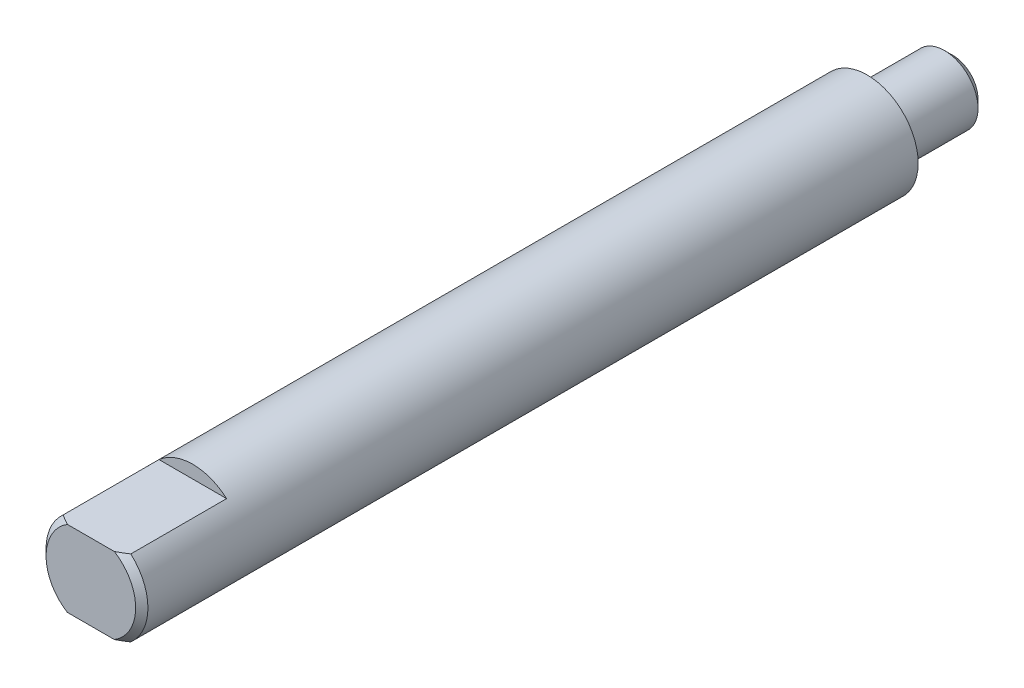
ISO-10303-21;
HEADER;
FILE_DESCRIPTION(('STEP AP214'),'2;1');
FILE_NAME('part.step','',(''),(''),'','','');
FILE_SCHEMA(('AUTOMOTIVE_DESIGN { 1 0 10303 214 1 1 1 1 }'));
ENDSEC;
DATA;
#1=APPLICATION_CONTEXT('core data for automotive mechanical design processes');
#2=APPLICATION_PROTOCOL_DEFINITION('international standard','automotive_design',2000,#1);
#3=PRODUCT_CONTEXT('',#1,'mechanical');
#4=PRODUCT('Part','Part','',(#3));
#5=PRODUCT_RELATED_PRODUCT_CATEGORY('part','',(#4));
#6=PRODUCT_DEFINITION_FORMATION('','',#4);
#7=PRODUCT_DEFINITION_CONTEXT('part definition',#1,'design');
#8=PRODUCT_DEFINITION('design','',#6,#7);
#9=PRODUCT_DEFINITION_SHAPE('','',#8);
#10=(LENGTH_UNIT() NAMED_UNIT(*) SI_UNIT(.MILLI.,.METRE.));
#11=(NAMED_UNIT(*) PLANE_ANGLE_UNIT() SI_UNIT($,.RADIAN.));
#12=(NAMED_UNIT(*) SI_UNIT($,.STERADIAN.) SOLID_ANGLE_UNIT());
#13=UNCERTAINTY_MEASURE_WITH_UNIT(LENGTH_MEASURE(1.E-05),#10,'distance_accuracy_value','');
#14=(GEOMETRIC_REPRESENTATION_CONTEXT(3) GLOBAL_UNCERTAINTY_ASSIGNED_CONTEXT((#13)) GLOBAL_UNIT_ASSIGNED_CONTEXT((#10,
#11,#12)) REPRESENTATION_CONTEXT('',''));
#15=CARTESIAN_POINT('',(0.,0.,0.));
#16=DIRECTION('',(0.,0.,1.));
#17=DIRECTION('',(1.,0.,0.));
#18=AXIS2_PLACEMENT_3D('',#15,#16,#17);
#19=CARTESIAN_POINT('',(0.,0.,3.684));
#20=DIRECTION('',(0.,0.,-1.));
#21=DIRECTION('',(-1.,0.,0.));
#22=AXIS2_PLACEMENT_3D('',#19,#20,#21);
#23=CONICAL_SURFACE('',#22,3.175,0.791934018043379);
#24=CARTESIAN_POINT('',(0.,0.,3.684));
#25=DIRECTION('',(0.,0.,1.));
#26=DIRECTION('',(1.,0.,0.));
#27=AXIS2_PLACEMENT_3D('',#24,#25,#26);
#28=CIRCLE('',#27,3.175);
#29=CARTESIAN_POINT('',(-2.10713075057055,2.375,3.684));
#30=VERTEX_POINT('',#29);
#31=CARTESIAN_POINT('',(-2.10713075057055,-2.375,3.684));
#32=VERTEX_POINT('',#31);
#33=EDGE_CURVE('E105',#30,#32,#28,.T.);
#34=ORIENTED_EDGE('',*,*,#33,.T.);
#35=CARTESIAN_POINT('',(-6.62966945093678,-2.375,-0.13301595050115));
#36=CARTESIAN_POINT('',(-6.41872085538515,-2.375,0.0629362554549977));
#37=CARTESIAN_POINT('',(-6.20729327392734,-2.375,0.258380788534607));
#38=CARTESIAN_POINT('',(-5.78286017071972,-2.375,0.64788739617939));
#39=CARTESIAN_POINT('',(-5.56985352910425,-2.375,0.841948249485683));
#40=CARTESIAN_POINT('',(-5.13574053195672,-2.375,1.23363349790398));
#41=CARTESIAN_POINT('',(-4.9145790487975,-2.375,1.43119690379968));
#42=CARTESIAN_POINT('',(-4.46963283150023,-2.375,1.82304516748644));
#43=CARTESIAN_POINT('',(-4.24585006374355,-2.375,2.01733224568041));
#44=CARTESIAN_POINT('',(-3.90719638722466,-2.375,2.30510248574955));
#45=CARTESIAN_POINT('',(-3.79385459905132,-2.375,2.40038380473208));
#46=CARTESIAN_POINT('',(-3.56590809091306,-2.375,2.5894215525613));
#47=CARTESIAN_POINT('',(-3.4513034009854,-2.375,2.68317801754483));
#48=CARTESIAN_POINT('',(-3.22025369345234,-2.375,2.86895465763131));
#49=CARTESIAN_POINT('',(-3.10380502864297,-2.375,2.96097030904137));
#50=CARTESIAN_POINT('',(-2.8689222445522,-2.375,3.14241965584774));
#51=CARTESIAN_POINT('',(-2.75048831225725,-2.375,3.23185359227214));
#52=CARTESIAN_POINT('',(-2.51255729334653,-2.375,3.40617108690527));
#53=CARTESIAN_POINT('',(-2.3930916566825,-2.375,3.49109735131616));
#54=CARTESIAN_POINT('',(-2.1509050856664,-2.375,3.65634247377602));
#55=CARTESIAN_POINT('',(-2.02818269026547,-2.375,3.73665921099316));
#56=CARTESIAN_POINT('',(-1.77912466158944,-2.375,3.89039659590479));
#57=CARTESIAN_POINT('',(-1.65280524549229,-2.375,3.96384327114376));
#58=CARTESIAN_POINT('',(-1.39512518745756,-2.375,4.10119391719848));
#59=CARTESIAN_POINT('',(-1.26377071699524,-2.375,4.16510912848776));
#60=CARTESIAN_POINT('',(-1.05701971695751,-2.375,4.25273595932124));
#61=CARTESIAN_POINT('',(-0.983728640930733,-2.375,4.28140199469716));
#62=CARTESIAN_POINT('',(-0.83535687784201,-2.375,4.3337772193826));
#63=CARTESIAN_POINT('',(-0.760275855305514,-2.375,4.35748547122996));
#64=CARTESIAN_POINT('',(-0.608898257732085,-2.375,4.39885359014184));
#65=CARTESIAN_POINT('',(-0.532610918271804,-2.375,4.41654679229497));
#66=CARTESIAN_POINT('',(-0.378780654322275,-2.375,4.445154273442));
#67=CARTESIAN_POINT('',(-0.301238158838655,-2.375,4.45607082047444));
#68=CARTESIAN_POINT('',(-0.144559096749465,-2.375,4.47054748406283));
#69=CARTESIAN_POINT('',(-0.0654144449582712,-2.375,4.47402190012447));
#70=CARTESIAN_POINT('',(0.0928249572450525,-2.375,4.47312081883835));
#71=CARTESIAN_POINT('',(0.171919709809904,-2.375,4.4687456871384));
#72=CARTESIAN_POINT('',(0.329626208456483,-2.375,4.45241265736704));
#73=CARTESIAN_POINT('',(0.408234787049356,-2.375,4.44042470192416));
#74=CARTESIAN_POINT('',(0.56408615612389,-2.375,4.40957980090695));
#75=CARTESIAN_POINT('',(0.641328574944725,-2.375,4.39072101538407));
#76=CARTESIAN_POINT('',(0.827865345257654,-2.375,4.33746225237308));
#77=CARTESIAN_POINT('',(0.936246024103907,-2.375,4.29987709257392));
#78=CARTESIAN_POINT('',(1.14927492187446,-2.375,4.21535984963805));
#79=CARTESIAN_POINT('',(1.25392057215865,-2.375,4.16842147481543));
#80=CARTESIAN_POINT('',(1.46087103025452,-2.375,4.06709514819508));
#81=CARTESIAN_POINT('',(1.56313950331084,-2.375,4.01263383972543));
#82=CARTESIAN_POINT('',(1.71427099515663,-2.375,3.92703840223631));
#83=CARTESIAN_POINT('',(1.76426245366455,-2.375,3.89786057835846));
#84=CARTESIAN_POINT('',(1.86356372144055,-2.375,3.83837009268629));
#85=CARTESIAN_POINT('',(1.91287355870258,-2.375,3.80805747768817));
#86=CARTESIAN_POINT('',(2.07522042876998,-2.375,3.70601224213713));
#87=CARTESIAN_POINT('',(2.18692206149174,-2.375,3.63215349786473));
#88=CARTESIAN_POINT('',(2.40772318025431,-2.375,3.48062951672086));
#89=CARTESIAN_POINT('',(2.5168220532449,-2.375,3.40296339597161));
#90=CARTESIAN_POINT('',(2.73301390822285,-2.375,3.24473477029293));
#91=CARTESIAN_POINT('',(2.84010537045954,-2.375,3.16417019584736));
#92=CARTESIAN_POINT('',(3.05261723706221,-2.375,3.00086187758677));
#93=CARTESIAN_POINT('',(3.15803753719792,-2.375,2.9181179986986));
#94=CARTESIAN_POINT('',(3.47300086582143,-2.375,2.6667998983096));
#95=CARTESIAN_POINT('',(3.68051445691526,-2.375,2.49568568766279));
#96=CARTESIAN_POINT('',(4.09182405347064,-2.375,2.14926116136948));
#97=CARTESIAN_POINT('',(4.29562161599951,-2.375,1.97395267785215));
#98=CARTESIAN_POINT('',(4.67931232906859,-2.375,1.63905531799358));
#99=CARTESIAN_POINT('',(4.85946034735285,-2.375,1.47975783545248));
#100=CARTESIAN_POINT('',(5.21824582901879,-2.375,1.15942835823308));
#101=CARTESIAN_POINT('',(5.39688309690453,-2.375,0.998396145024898));
#102=CARTESIAN_POINT('',(5.75173692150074,-2.375,0.676174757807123));
#103=CARTESIAN_POINT('',(5.92796166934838,-2.375,0.514994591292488));
#104=CARTESIAN_POINT('',(6.27946145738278,-2.375,0.191659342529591));
#105=CARTESIAN_POINT('',(6.45473664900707,-2.375,0.0295044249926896));
#106=CARTESIAN_POINT('',(6.62966945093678,-2.375,-0.13301595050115));
#107=B_SPLINE_CURVE_WITH_KNOTS('',3,(#35,#36,#37,#38,#39,#40,#41,#42,#43,#44,#45,#46,#47,#48,
#49,#50,#51,#52,#53,#54,#55,#56,#57,#58,#59,#60,#61,#62,#63,#64,#65,#66,#67,#68,#69,#70,#71,#72,
#73,#74,#75,#76,#77,#78,#79,#80,#81,#82,#83,#84,#85,#86,#87,#88,#89,#90,#91,#92,#93,#94,#95,#96,
#97,#98,#99,#100,#101,#102,#103,#104,#105,#106),.UNSPECIFIED.,.F.,.F.,(4,2,2,2,2,2,2,2,2,2,2,2,
2,2,2,2,2,2,2,2,2,2,2,2,2,2,2,2,2,2,2,2,2,2,2,4),(0.,0.863760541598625,1.72820709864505,
2.61784876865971,3.50686109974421,3.95106286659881,4.39525409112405,4.84047397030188,
5.28565214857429,5.72530383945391,6.16515621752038,6.60326828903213,7.04085953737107,
7.2768120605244,7.51280915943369,7.74747620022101,7.98206465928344,8.21934033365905,
8.45660495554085,8.69481223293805,8.93308334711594,9.27660606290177,9.62036064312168,
9.96774119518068,10.1413805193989,10.3150126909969,10.7166254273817,11.1183318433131,
11.5203310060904,11.9223551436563,12.7291420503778,13.5355827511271,14.2569976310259,
14.9785044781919,15.6949553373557,16.4112883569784),.UNSPECIFIED.);
#108=CARTESIAN_POINT('',(-1.46406113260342,-2.375,4.064));
#109=VERTEX_POINT('',#108);
#110=EDGE_CURVE('E128',#32,#109,#107,.T.);
#111=ORIENTED_EDGE('',*,*,#110,.T.);
#112=CARTESIAN_POINT('',(0.,0.,4.064));
#113=DIRECTION('',(0.,0.,1.));
#114=DIRECTION('',(1.,0.,0.));
#115=AXIS2_PLACEMENT_3D('',#112,#113,#114);
#116=CIRCLE('',#115,2.79);
#117=CARTESIAN_POINT('',(-1.46406113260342,2.375,4.064));
#118=VERTEX_POINT('',#117);
#119=EDGE_CURVE('E115',#118,#109,#116,.T.);
#120=ORIENTED_EDGE('',*,*,#119,.F.);
#121=CARTESIAN_POINT('',(6.62966945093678,2.375,-0.13301595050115));
#122=CARTESIAN_POINT('',(6.41872085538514,2.375,0.0629362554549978));
#123=CARTESIAN_POINT('',(6.20729327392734,2.375,0.258380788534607));
#124=CARTESIAN_POINT('',(5.78286017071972,2.375,0.64788739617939));
#125=CARTESIAN_POINT('',(5.56985352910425,2.375,0.841948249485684));
#126=CARTESIAN_POINT('',(5.13574053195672,2.375,1.23363349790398));
#127=CARTESIAN_POINT('',(4.9145790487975,2.375,1.43119690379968));
#128=CARTESIAN_POINT('',(4.46963283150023,2.375,1.82304516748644));
#129=CARTESIAN_POINT('',(4.24585006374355,2.375,2.01733224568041));
#130=CARTESIAN_POINT('',(3.90719638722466,2.375,2.30510248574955));
#131=CARTESIAN_POINT('',(3.79385459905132,2.375,2.40038380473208));
#132=CARTESIAN_POINT('',(3.56590809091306,2.375,2.5894215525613));
#133=CARTESIAN_POINT('',(3.4513034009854,2.375,2.68317801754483));
#134=CARTESIAN_POINT('',(3.22025369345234,2.375,2.86895465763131));
#135=CARTESIAN_POINT('',(3.10380502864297,2.375,2.96097030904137));
#136=CARTESIAN_POINT('',(2.8689222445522,2.375,3.14241965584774));
#137=CARTESIAN_POINT('',(2.75048831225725,2.375,3.23185359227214));
#138=CARTESIAN_POINT('',(2.51255729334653,2.375,3.40617108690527));
#139=CARTESIAN_POINT('',(2.3930916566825,2.375,3.49109735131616));
#140=CARTESIAN_POINT('',(2.1509050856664,2.375,3.65634247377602));
#141=CARTESIAN_POINT('',(2.02818269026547,2.375,3.73665921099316));
#142=CARTESIAN_POINT('',(1.77912466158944,2.375,3.89039659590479));
#143=CARTESIAN_POINT('',(1.65280524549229,2.375,3.96384327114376));
#144=CARTESIAN_POINT('',(1.39512518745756,2.375,4.10119391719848));
#145=CARTESIAN_POINT('',(1.26377071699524,2.375,4.16510912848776));
#146=CARTESIAN_POINT('',(1.05701971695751,2.375,4.25273595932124));
#147=CARTESIAN_POINT('',(0.983728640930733,2.375,4.28140199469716));
#148=CARTESIAN_POINT('',(0.83535687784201,2.375,4.3337772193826));
#149=CARTESIAN_POINT('',(0.760275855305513,2.375,4.35748547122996));
#150=CARTESIAN_POINT('',(0.608898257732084,2.375,4.39885359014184));
#151=CARTESIAN_POINT('',(0.532610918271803,2.375,4.41654679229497));
#152=CARTESIAN_POINT('',(0.378780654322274,2.375,4.445154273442));
#153=CARTESIAN_POINT('',(0.301238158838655,2.375,4.45607082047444));
#154=CARTESIAN_POINT('',(0.144559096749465,2.375,4.47054748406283));
#155=CARTESIAN_POINT('',(0.0654144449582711,2.375,4.47402190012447));
#156=CARTESIAN_POINT('',(-0.0928249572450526,2.375,4.47312081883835));
#157=CARTESIAN_POINT('',(-0.171919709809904,2.375,4.4687456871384));
#158=CARTESIAN_POINT('',(-0.329626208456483,2.375,4.45241265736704));
#159=CARTESIAN_POINT('',(-0.408234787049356,2.375,4.44042470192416));
#160=CARTESIAN_POINT('',(-0.56408615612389,2.375,4.40957980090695));
#161=CARTESIAN_POINT('',(-0.641328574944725,2.375,4.39072101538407));
#162=CARTESIAN_POINT('',(-0.827865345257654,2.375,4.33746225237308));
#163=CARTESIAN_POINT('',(-0.936246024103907,2.375,4.29987709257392));
#164=CARTESIAN_POINT('',(-1.14927492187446,2.375,4.21535984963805));
#165=CARTESIAN_POINT('',(-1.25392057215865,2.375,4.16842147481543));
#166=CARTESIAN_POINT('',(-1.46087103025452,2.375,4.06709514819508));
#167=CARTESIAN_POINT('',(-1.56313950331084,2.375,4.01263383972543));
#168=CARTESIAN_POINT('',(-1.71427099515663,2.375,3.92703840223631));
#169=CARTESIAN_POINT('',(-1.76426245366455,2.375,3.89786057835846));
#170=CARTESIAN_POINT('',(-1.86356372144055,2.375,3.83837009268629));
#171=CARTESIAN_POINT('',(-1.91287355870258,2.375,3.80805747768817));
#172=CARTESIAN_POINT('',(-2.07522042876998,2.375,3.70601224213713));
#173=CARTESIAN_POINT('',(-2.18692206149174,2.375,3.63215349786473));
#174=CARTESIAN_POINT('',(-2.40772318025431,2.375,3.48062951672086));
#175=CARTESIAN_POINT('',(-2.51682205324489,2.375,3.40296339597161));
#176=CARTESIAN_POINT('',(-2.73301390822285,2.375,3.24473477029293));
#177=CARTESIAN_POINT('',(-2.84010537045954,2.375,3.16417019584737));
#178=CARTESIAN_POINT('',(-3.05261723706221,2.375,3.00086187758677));
#179=CARTESIAN_POINT('',(-3.15803753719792,2.375,2.91811799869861));
#180=CARTESIAN_POINT('',(-3.47300086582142,2.375,2.66679989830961));
#181=CARTESIAN_POINT('',(-3.68051445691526,2.375,2.49568568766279));
#182=CARTESIAN_POINT('',(-4.09182405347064,2.375,2.14926116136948));
#183=CARTESIAN_POINT('',(-4.29562161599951,2.375,1.97395267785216));
#184=CARTESIAN_POINT('',(-4.67931232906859,2.375,1.63905531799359));
#185=CARTESIAN_POINT('',(-4.85946034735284,2.375,1.47975783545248));
#186=CARTESIAN_POINT('',(-5.21824582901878,2.375,1.15942835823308));
#187=CARTESIAN_POINT('',(-5.39688309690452,2.375,0.998396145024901));
#188=CARTESIAN_POINT('',(-5.75173692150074,2.375,0.676174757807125));
#189=CARTESIAN_POINT('',(-5.92796166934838,2.375,0.514994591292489));
#190=CARTESIAN_POINT('',(-6.27946145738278,2.375,0.191659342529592));
#191=CARTESIAN_POINT('',(-6.45473664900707,2.375,0.0295044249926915));
#192=CARTESIAN_POINT('',(-6.62966945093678,2.375,-0.13301595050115));
#193=B_SPLINE_CURVE_WITH_KNOTS('',3,(#121,#122,#123,#124,#125,#126,#127,#128,#129,#130,#131,
#132,#133,#134,#135,#136,#137,#138,#139,#140,#141,#142,#143,#144,#145,#146,#147,#148,#149,#150,
#151,#152,#153,#154,#155,#156,#157,#158,#159,#160,#161,#162,#163,#164,#165,#166,#167,#168,#169,
#170,#171,#172,#173,#174,#175,#176,#177,#178,#179,#180,#181,#182,#183,#184,#185,#186,#187,#188,
#189,#190,#191,#192),.UNSPECIFIED.,.F.,.F.,(4,2,2,2,2,2,2,2,2,2,2,2,2,2,2,2,2,2,2,2,2,2,2,2,2,2,
2,2,2,2,2,2,2,2,2,4),(0.,0.863760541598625,1.72820709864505,2.61784876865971,3.50686109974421,
3.95106286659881,4.39525409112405,4.84047397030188,5.28565214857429,5.72530383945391,
6.16515621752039,6.60326828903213,7.04085953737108,7.2768120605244,7.51280915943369,
7.74747620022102,7.98206465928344,8.21934033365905,8.45660495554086,8.69481223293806,
8.93308334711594,9.27660606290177,9.62036064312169,9.96774119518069,10.1413805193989,
10.3150126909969,10.7166254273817,11.1183318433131,11.5203310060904,11.9223551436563,
12.7291420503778,13.5355827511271,14.2569976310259,14.9785044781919,15.6949553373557,
16.4112883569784),.UNSPECIFIED.);
#194=EDGE_CURVE('E129',#118,#30,#193,.T.);
#195=ORIENTED_EDGE('',*,*,#194,.T.);
#196=EDGE_LOOP('',(#34,#111,#120,#195));
#197=FACE_BOUND('',#196,.T.);
#198=ADVANCED_FACE('F33',(#197),#23,.T.);
#199=CARTESIAN_POINT('',(0.,0.,4.064));
#200=DIRECTION('',(0.,0.,-1.));
#201=DIRECTION('',(-1.,0.,0.));
#202=AXIS2_PLACEMENT_3D('',#199,#200,#201);
#203=PLANE('',#202);
#204=ORIENTED_EDGE('',*,*,#119,.T.);
#205=DIRECTION('',(1.,0.,0.));
#206=VECTOR('',#205,1.);
#207=CARTESIAN_POINT('',(-5.,-2.375,4.064));
#208=LINE('',#207,#206);
#209=CARTESIAN_POINT('',(1.46406113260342,-2.375,4.064));
#210=VERTEX_POINT('',#209);
#211=EDGE_CURVE('E95',#109,#210,#208,.T.);
#212=ORIENTED_EDGE('',*,*,#211,.T.);
#213=CARTESIAN_POINT('',(1.46406113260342,2.375,4.064));
#214=VERTEX_POINT('',#213);
#215=EDGE_CURVE('E109',#210,#214,#116,.T.);
#216=ORIENTED_EDGE('',*,*,#215,.T.);
#217=DIRECTION('',(1.,0.,0.));
#218=VECTOR('',#217,1.);
#219=CARTESIAN_POINT('',(-5.,2.375,4.064));
#220=LINE('',#219,#218);
#221=EDGE_CURVE('E135',#118,#214,#220,.T.);
#222=ORIENTED_EDGE('',*,*,#221,.F.);
#223=EDGE_LOOP('',(#204,#212,#216,#222));
#224=FACE_BOUND('',#223,.T.);
#225=ADVANCED_FACE('F35',(#224),#203,.F.);
#226=ORIENTED_EDGE('',*,*,#215,.F.);
#227=CARTESIAN_POINT('',(2.10713075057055,-2.375,3.684));
#228=VERTEX_POINT('',#227);
#229=EDGE_CURVE('E94',#210,#228,#107,.T.);
#230=ORIENTED_EDGE('',*,*,#229,.T.);
#231=CARTESIAN_POINT('',(2.10713075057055,2.375,3.684));
#232=VERTEX_POINT('',#231);
#233=EDGE_CURVE('E101',#228,#232,#28,.T.);
#234=ORIENTED_EDGE('',*,*,#233,.T.);
#235=EDGE_CURVE('E132',#232,#214,#193,.T.);
#236=ORIENTED_EDGE('',*,*,#235,.T.);
#237=EDGE_LOOP('',(#226,#230,#234,#236));
#238=FACE_BOUND('',#237,.T.);
#239=ADVANCED_FACE('F144',(#238),#23,.T.);
#240=CARTESIAN_POINT('',(0.,0.,4.064));
#241=DIRECTION('',(0.,0.,1.));
#242=DIRECTION('',(1.,0.,0.));
#243=AXIS2_PLACEMENT_3D('',#240,#241,#242);
#244=CYLINDRICAL_SURFACE('',#243,3.175);
#245=ORIENTED_EDGE('',*,*,#233,.F.);
#246=DIRECTION('',(0.,0.,1.));
#247=VECTOR('',#246,1.);
#248=CARTESIAN_POINT('',(2.10713075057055,-2.375,4.064));
#249=LINE('',#248,#247);
#250=CARTESIAN_POINT('',(2.10713075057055,-2.375,-2.286));
#251=VERTEX_POINT('',#250);
#252=EDGE_CURVE('E11',#228,#251,#249,.F.);
#253=ORIENTED_EDGE('',*,*,#252,.T.);
#254=CARTESIAN_POINT('',(0.,0.,-2.28599999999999));
#255=DIRECTION('',(0.,0.,-1.));
#256=DIRECTION('',(0.,1.,0.));
#257=AXIS2_PLACEMENT_3D('',#254,#255,#256);
#258=CIRCLE('',#257,3.175);
#259=CARTESIAN_POINT('',(-2.10713075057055,-2.375,-2.286));
#260=VERTEX_POINT('',#259);
#261=EDGE_CURVE('E85',#251,#260,#258,.T.);
#262=ORIENTED_EDGE('',*,*,#261,.T.);
#263=DIRECTION('',(0.,0.,1.));
#264=VECTOR('',#263,1.);
#265=CARTESIAN_POINT('',(-2.10713075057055,-2.375,4.064));
#266=LINE('',#265,#264);
#267=EDGE_CURVE('E41',#260,#32,#266,.T.);
#268=ORIENTED_EDGE('',*,*,#267,.T.);
#269=ORIENTED_EDGE('',*,*,#33,.F.);
#270=DIRECTION('',(0.,0.,1.));
#271=VECTOR('',#270,1.);
#272=CARTESIAN_POINT('',(-2.10713075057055,2.375,4.064));
#273=LINE('',#272,#271);
#274=CARTESIAN_POINT('',(-2.10713075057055,2.375,-2.286));
#275=VERTEX_POINT('',#274);
#276=EDGE_CURVE('E118',#30,#275,#273,.F.);
#277=ORIENTED_EDGE('',*,*,#276,.T.);
#278=CARTESIAN_POINT('',(0.,0.,-2.28599999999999));
#279=DIRECTION('',(0.,0.,-1.));
#280=DIRECTION('',(0.,1.,0.));
#281=AXIS2_PLACEMENT_3D('',#278,#279,#280);
#282=CIRCLE('',#281,3.175);
#283=CARTESIAN_POINT('',(2.10713075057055,2.375,-2.286));
#284=VERTEX_POINT('',#283);
#285=EDGE_CURVE('E121',#275,#284,#282,.T.);
#286=ORIENTED_EDGE('',*,*,#285,.T.);
#287=DIRECTION('',(0.,0.,1.));
#288=VECTOR('',#287,1.);
#289=CARTESIAN_POINT('',(2.10713075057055,2.375,4.064));
#290=LINE('',#289,#288);
#291=EDGE_CURVE('E89',#284,#232,#290,.T.);
#292=ORIENTED_EDGE('',*,*,#291,.T.);
#293=EDGE_LOOP('',(#245,#253,#262,#268,#269,#277,#286,#292));
#294=FACE_BOUND('',#293,.T.);
#295=CARTESIAN_POINT('',(0.,0.,-44.2976));
#296=DIRECTION('',(0.,0.,1.));
#297=DIRECTION('',(1.,0.,0.));
#298=AXIS2_PLACEMENT_3D('',#295,#296,#297);
#299=CIRCLE('',#298,3.175);
#300=CARTESIAN_POINT('',(3.175,0.,-44.2976));
#301=VERTEX_POINT('',#300);
#302=EDGE_CURVE('E106',#301,#301,#299,.T.);
#303=ORIENTED_EDGE('',*,*,#302,.T.);
#304=EDGE_LOOP('',(#303));
#305=FACE_BOUND('',#304,.T.);
#306=ADVANCED_FACE('F98',(#294,#305),#244,.T.);
#307=CARTESIAN_POINT('',(0.,2.0828,-44.2976));
#308=DIRECTION('',(0.,0.,1.));
#309=DIRECTION('',(1.,0.,0.));
#310=AXIS2_PLACEMENT_3D('',#307,#308,#309);
#311=PLANE('',#310);
#312=ORIENTED_EDGE('',*,*,#302,.F.);
#313=EDGE_LOOP('',(#312));
#314=FACE_BOUND('',#313,.T.);
#315=CARTESIAN_POINT('',(0.,0.,-44.2976));
#316=DIRECTION('',(0.,0.,1.));
#317=DIRECTION('',(1.,0.,0.));
#318=AXIS2_PLACEMENT_3D('',#315,#316,#317);
#319=CIRCLE('',#318,2.0828);
#320=CARTESIAN_POINT('',(2.0828,0.,-44.2976));
#321=VERTEX_POINT('',#320);
#322=EDGE_CURVE('E111',#321,#321,#319,.T.);
#323=ORIENTED_EDGE('',*,*,#322,.T.);
#324=EDGE_LOOP('',(#323));
#325=FACE_BOUND('',#324,.T.);
#326=ADVANCED_FACE('F165',(#314,#325),#311,.F.);
#327=CARTESIAN_POINT('',(0.,0.,4.064));
#328=DIRECTION('',(0.,0.,1.));
#329=DIRECTION('',(1.,0.,0.));
#330=AXIS2_PLACEMENT_3D('',#327,#328,#329);
#331=CYLINDRICAL_SURFACE('',#330,2.0828);
#332=ORIENTED_EDGE('',*,*,#322,.F.);
#333=EDGE_LOOP('',(#332));
#334=FACE_BOUND('',#333,.T.);
#335=CARTESIAN_POINT('',(0.,0.,-49.1176));
#336=DIRECTION('',(0.,0.,1.));
#337=DIRECTION('',(1.,0.,0.));
#338=AXIS2_PLACEMENT_3D('',#335,#336,#337);
#339=CIRCLE('',#338,2.0828);
#340=CARTESIAN_POINT('',(2.0828,0.,-49.1176));
#341=VERTEX_POINT('',#340);
#342=EDGE_CURVE('E263',#341,#341,#339,.T.);
#343=ORIENTED_EDGE('',*,*,#342,.T.);
#344=EDGE_LOOP('',(#343));
#345=FACE_BOUND('',#344,.T.);
#346=ADVANCED_FACE('F161',(#334,#345),#331,.T.);
#347=CARTESIAN_POINT('',(0.,0.,-49.6276));
#348=DIRECTION('',(0.,0.,1.));
#349=DIRECTION('',(1.,0.,0.));
#350=AXIS2_PLACEMENT_3D('',#347,#348,#349);
#351=CONICAL_SURFACE('',#350,1.5728,0.785398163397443);
#352=ORIENTED_EDGE('',*,*,#342,.F.);
#353=EDGE_LOOP('',(#352));
#354=FACE_BOUND('',#353,.T.);
#355=CARTESIAN_POINT('',(0.,0.,-49.6276));
#356=DIRECTION('',(0.,0.,1.));
#357=DIRECTION('',(1.,0.,0.));
#358=AXIS2_PLACEMENT_3D('',#355,#356,#357);
#359=CIRCLE('',#358,1.5728);
#360=CARTESIAN_POINT('',(1.5728,0.,-49.6276));
#361=VERTEX_POINT('',#360);
#362=EDGE_CURVE('E134',#361,#361,#359,.T.);
#363=ORIENTED_EDGE('',*,*,#362,.T.);
#364=EDGE_LOOP('',(#363));
#365=FACE_BOUND('',#364,.T.);
#366=ADVANCED_FACE('F157',(#354,#365),#351,.T.);
#367=CARTESIAN_POINT('',(0.,0.,-49.6276));
#368=DIRECTION('',(0.,0.,1.));
#369=DIRECTION('',(1.,0.,0.));
#370=AXIS2_PLACEMENT_3D('',#367,#368,#369);
#371=PLANE('',#370);
#372=ORIENTED_EDGE('',*,*,#362,.F.);
#373=EDGE_LOOP('',(#372));
#374=FACE_BOUND('',#373,.T.);
#375=ADVANCED_FACE('F154',(#374),#371,.F.);
#376=CARTESIAN_POINT('',(-5.,2.375,-2.286));
#377=DIRECTION('',(0.,0.,-1.));
#378=DIRECTION('',(0.,1.,0.));
#379=AXIS2_PLACEMENT_3D('',#376,#377,#378);
#380=PLANE('',#379);
#381=ORIENTED_EDGE('',*,*,#285,.F.);
#382=DIRECTION('',(1.,0.,0.));
#383=VECTOR('',#382,1.);
#384=CARTESIAN_POINT('',(-5.,2.375,-2.286));
#385=LINE('',#384,#383);
#386=EDGE_CURVE('E55',#275,#284,#385,.T.);
#387=ORIENTED_EDGE('',*,*,#386,.T.);
#388=EDGE_LOOP('',(#381,#387));
#389=FACE_BOUND('',#388,.T.);
#390=ADVANCED_FACE('F152',(#389),#380,.F.);
#391=CARTESIAN_POINT('',(-5.,2.375,4.064));
#392=DIRECTION('',(0.,-1.,0.));
#393=DIRECTION('',(0.,0.,-1.));
#394=AXIS2_PLACEMENT_3D('',#391,#392,#393);
#395=PLANE('',#394);
#396=ORIENTED_EDGE('',*,*,#291,.F.);
#397=ORIENTED_EDGE('',*,*,#386,.F.);
#398=ORIENTED_EDGE('',*,*,#276,.F.);
#399=ORIENTED_EDGE('',*,*,#194,.F.);
#400=ORIENTED_EDGE('',*,*,#221,.T.);
#401=ORIENTED_EDGE('',*,*,#235,.F.);
#402=EDGE_LOOP('',(#396,#397,#398,#399,#400,#401));
#403=FACE_BOUND('',#402,.T.);
#404=ADVANCED_FACE('F147',(#403),#395,.F.);
#405=CARTESIAN_POINT('',(-5.,-2.375,4.064));
#406=DIRECTION('',(0.,1.,0.));
#407=DIRECTION('',(0.,0.,1.));
#408=AXIS2_PLACEMENT_3D('',#405,#406,#407);
#409=PLANE('',#408);
#410=ORIENTED_EDGE('',*,*,#267,.F.);
#411=DIRECTION('',(1.,0.,0.));
#412=VECTOR('',#411,1.);
#413=CARTESIAN_POINT('',(-5.,-2.375,-2.286));
#414=LINE('',#413,#412);
#415=EDGE_CURVE('E47',#260,#251,#414,.T.);
#416=ORIENTED_EDGE('',*,*,#415,.T.);
#417=ORIENTED_EDGE('',*,*,#252,.F.);
#418=ORIENTED_EDGE('',*,*,#229,.F.);
#419=ORIENTED_EDGE('',*,*,#211,.F.);
#420=ORIENTED_EDGE('',*,*,#110,.F.);
#421=EDGE_LOOP('',(#410,#416,#417,#418,#419,#420));
#422=FACE_BOUND('',#421,.T.);
#423=ADVANCED_FACE('F92',(#422),#409,.F.);
#424=CARTESIAN_POINT('',(-5.,-2.375,-2.286));
#425=DIRECTION('',(0.,0.,-1.));
#426=DIRECTION('',(0.,1.,0.));
#427=AXIS2_PLACEMENT_3D('',#424,#425,#426);
#428=PLANE('',#427);
#429=ORIENTED_EDGE('',*,*,#415,.F.);
#430=ORIENTED_EDGE('',*,*,#261,.F.);
#431=EDGE_LOOP('',(#429,#430));
#432=FACE_BOUND('',#431,.T.);
#433=ADVANCED_FACE('F86',(#432),#428,.F.);
#434=CLOSED_SHELL('',(#198,#225,#239,#306,#326,#346,#366,#375,#390,#404,#423,#433));
#435=MANIFOLD_SOLID_BREP('B2',#434);
#436=ADVANCED_BREP_SHAPE_REPRESENTATION('',(#18,#435),#14);
#437=SHAPE_DEFINITION_REPRESENTATION(#9,#436);
ENDSEC;
END-ISO-10303-21;
